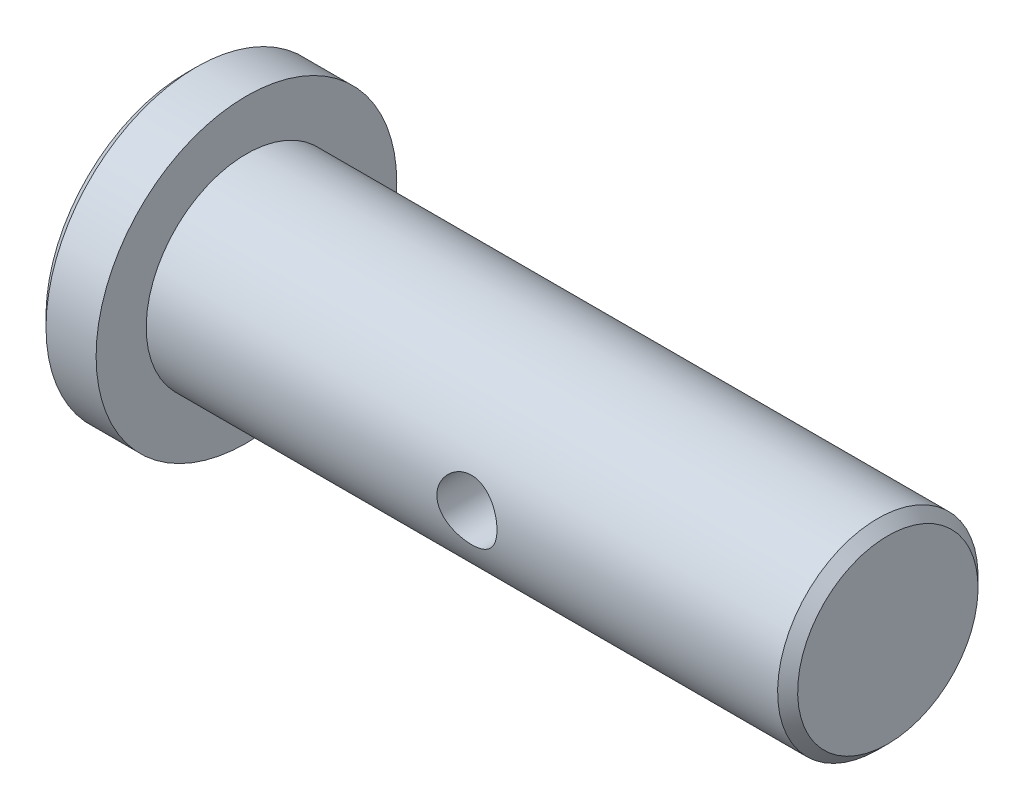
from build123d import *

# Parameters (mm, degrees)
CHANFREIN1_SIZE         = 1
CHANFREIN2_SIZE         = 1
ESQUISSE2_R             = 3
ENL_V_MAT_EXTRU_1_DEPTH = 10


with BuildPart() as part:
    # Esquisse1 → R_volution1 (revolve)
    with BuildSketch(Plane.XY, mode=Mode.PRIVATE) as r_volution1_sk:
        Polygon((0, 0), (0, 15), (6, 15), (6, 10), (70, 10), (70, 0), align=None)
    revolve(r_volution1_sk.sketch.rotate(Axis((0, 0, 0), (1, 0, 0)), 180), axis=Axis((0, 0, 0), (1, 0, 0)))

    # Chanfrein1
    chanfrein1_edges = [part.edges().sort_by_distance(p)[0] for p in [
        (70, 10, 0),
    ]]
    chamfer(chanfrein1_edges, length=CHANFREIN1_SIZE)

    # Chanfrein2
    chanfrein2_edges = [part.edges().sort_by_distance(p)[0] for p in [
        (0, 15, 0),
    ]]
    chamfer(chanfrein2_edges, length=CHANFREIN2_SIZE)

    # Esquisse2 → Enl_v. mat.-Extru.1 (cut, symmetric)
    with BuildSketch(Plane.XY):
        with Locations((38, 0)):
            Circle(ESQUISSE2_R)
    extrude(amount=ENL_V_MAT_EXTRU_1_DEPTH, both=True, mode=Mode.SUBTRACT)


solid = part.part
